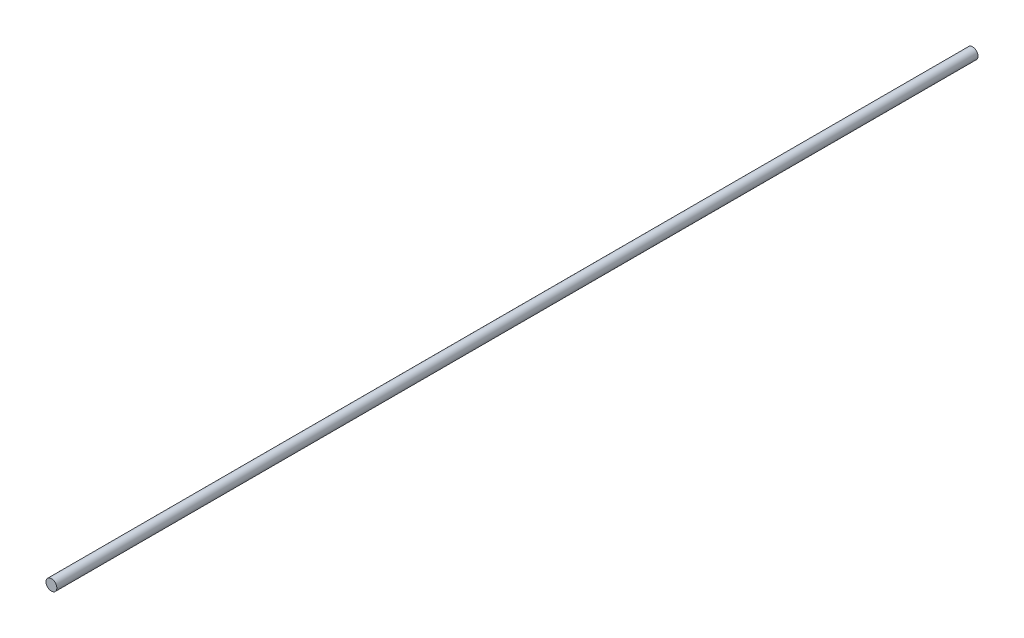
from build123d import *

# Parameters (mm, degrees)
SKETCH1_R           = 30
BOSS_EXTRUDE1_DEPTH = 5100


with BuildPart() as part:
    # Sketch1 → Boss-Extrude1 (new body)
    with BuildSketch(Plane.XY):
        Circle(SKETCH1_R)
    extrude(amount=-BOSS_EXTRUDE1_DEPTH)


solid = part.part
